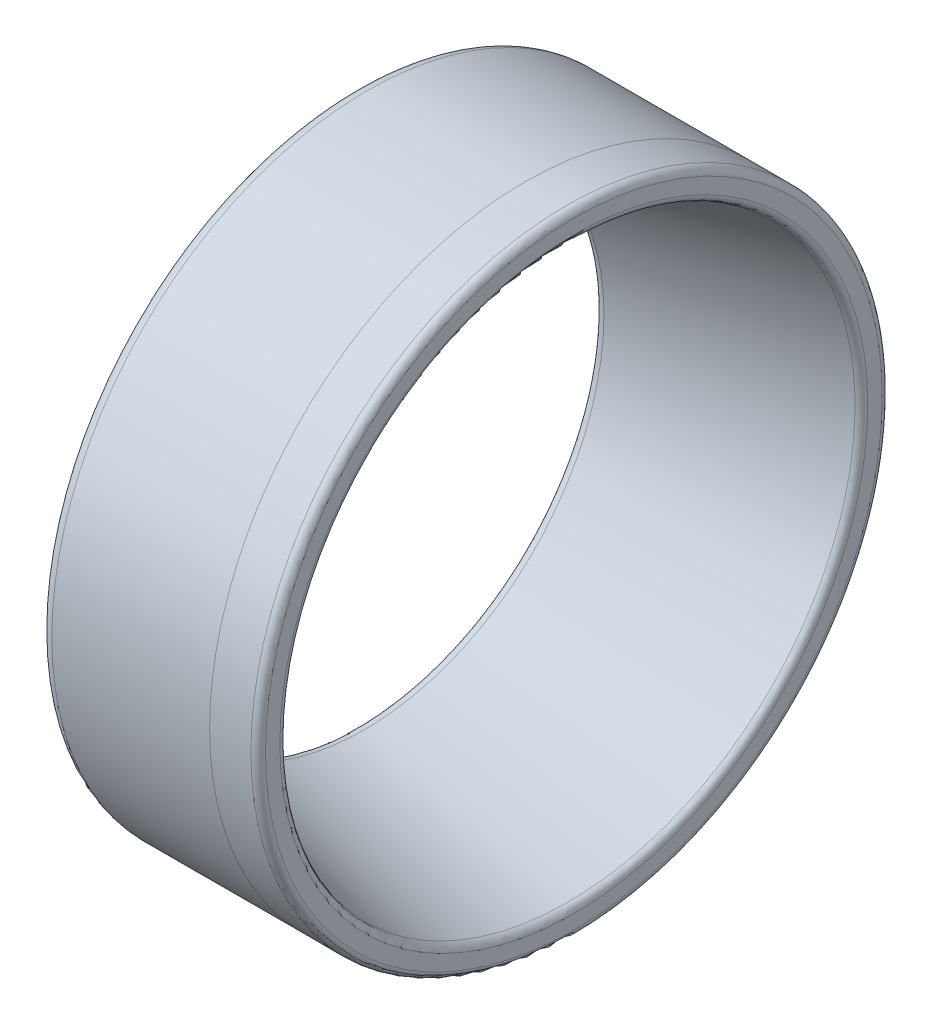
ISO-10303-21;
HEADER;
FILE_DESCRIPTION(('STEP AP214'),'2;1');
FILE_NAME('part.step','',(''),(''),'','','');
FILE_SCHEMA(('AUTOMOTIVE_DESIGN { 1 0 10303 214 1 1 1 1 }'));
ENDSEC;
DATA;
#1=APPLICATION_CONTEXT('core data for automotive mechanical design processes');
#2=APPLICATION_PROTOCOL_DEFINITION('international standard','automotive_design',2000,#1);
#3=PRODUCT_CONTEXT('',#1,'mechanical');
#4=PRODUCT('Part','Part','',(#3));
#5=PRODUCT_RELATED_PRODUCT_CATEGORY('part','',(#4));
#6=PRODUCT_DEFINITION_FORMATION('','',#4);
#7=PRODUCT_DEFINITION_CONTEXT('part definition',#1,'design');
#8=PRODUCT_DEFINITION('design','',#6,#7);
#9=PRODUCT_DEFINITION_SHAPE('','',#8);
#10=(LENGTH_UNIT() NAMED_UNIT(*) SI_UNIT(.MILLI.,.METRE.));
#11=(NAMED_UNIT(*) PLANE_ANGLE_UNIT() SI_UNIT($,.RADIAN.));
#12=(NAMED_UNIT(*) SI_UNIT($,.STERADIAN.) SOLID_ANGLE_UNIT());
#13=UNCERTAINTY_MEASURE_WITH_UNIT(LENGTH_MEASURE(1.E-05),#10,'distance_accuracy_value','');
#14=(GEOMETRIC_REPRESENTATION_CONTEXT(3) GLOBAL_UNCERTAINTY_ASSIGNED_CONTEXT((#13)) GLOBAL_UNIT_ASSIGNED_CONTEXT((#10,
#11,#12)) REPRESENTATION_CONTEXT('',''));
#15=CARTESIAN_POINT('',(0.,0.,0.));
#16=DIRECTION('',(0.,0.,1.));
#17=DIRECTION('',(1.,0.,0.));
#18=AXIS2_PLACEMENT_3D('',#15,#16,#17);
#19=CARTESIAN_POINT('',(-17.990056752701,0.,0.));
#20=DIRECTION('',(-1.,0.,0.));
#21=DIRECTION('',(0.,0.,1.));
#22=AXIS2_PLACEMENT_3D('',#19,#20,#21);
#23=CYLINDRICAL_SURFACE('',#22,26.);
#24=CARTESIAN_POINT('',(3.4,0.,0.));
#25=DIRECTION('',(-1.,0.,0.));
#26=DIRECTION('',(0.,0.,1.));
#27=AXIS2_PLACEMENT_3D('',#24,#25,#26);
#28=CIRCLE('',#27,26.);
#29=CARTESIAN_POINT('',(3.4,0.,26.));
#30=VERTEX_POINT('',#29);
#31=EDGE_CURVE('E74',#30,#30,#28,.T.);
#32=ORIENTED_EDGE('',*,*,#31,.T.);
#33=EDGE_LOOP('',(#32));
#34=FACE_BOUND('',#33,.T.);
#35=CARTESIAN_POINT('',(0.,0.,0.));
#36=DIRECTION('',(-1.,0.,0.));
#37=DIRECTION('',(0.,-1.,0.));
#38=AXIS2_PLACEMENT_3D('',#35,#36,#37);
#39=CIRCLE('',#38,26.);
#40=CARTESIAN_POINT('',(0.,-26.,0.));
#41=VERTEX_POINT('',#40);
#42=CARTESIAN_POINT('',(0.,26.,0.));
#43=VERTEX_POINT('',#42);
#44=EDGE_CURVE('E11',#41,#43,#39,.T.);
#45=ORIENTED_EDGE('',*,*,#44,.F.);
#46=EDGE_CURVE('E37',#43,#41,#39,.T.);
#47=ORIENTED_EDGE('',*,*,#46,.F.);
#48=EDGE_LOOP('',(#45,#47));
#49=FACE_BOUND('',#48,.T.);
#50=ADVANCED_FACE('F33',(#34,#49),#23,.T.);
#51=CARTESIAN_POINT('',(-13.,0.,0.));
#52=DIRECTION('',(-1.,0.,0.));
#53=DIRECTION('',(0.,0.,1.));
#54=AXIS2_PLACEMENT_3D('',#51,#52,#53);
#55=TOROIDAL_SURFACE('',#54,25.,1.);
#56=CARTESIAN_POINT('',(-14.,0.,0.));
#57=DIRECTION('',(-1.,0.,0.));
#58=DIRECTION('',(0.,0.,1.));
#59=AXIS2_PLACEMENT_3D('',#56,#57,#58);
#60=CIRCLE('',#59,25.);
#61=CARTESIAN_POINT('',(-14.,0.,25.));
#62=VERTEX_POINT('',#61);
#63=EDGE_CURVE('E52',#62,#62,#60,.T.);
#64=ORIENTED_EDGE('',*,*,#63,.F.);
#65=EDGE_LOOP('',(#64));
#66=FACE_BOUND('',#65,.T.);
#67=CARTESIAN_POINT('',(-13.,0.,0.));
#68=DIRECTION('',(-1.,0.,0.));
#69=DIRECTION('',(0.,0.,1.));
#70=AXIS2_PLACEMENT_3D('',#67,#68,#69);
#71=CIRCLE('',#70,26.);
#72=CARTESIAN_POINT('',(-13.,0.,26.));
#73=VERTEX_POINT('',#72);
#74=EDGE_CURVE('E77',#73,#73,#71,.T.);
#75=ORIENTED_EDGE('',*,*,#74,.T.);
#76=EDGE_LOOP('',(#75));
#77=FACE_BOUND('',#76,.T.);
#78=ADVANCED_FACE('F35',(#66,#77),#55,.T.);
#79=CARTESIAN_POINT('',(-14.,20.333869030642,0.));
#80=DIRECTION('',(1.,0.,0.));
#81=DIRECTION('',(0.,0.,-1.));
#82=AXIS2_PLACEMENT_3D('',#79,#80,#81);
#83=PLANE('',#82);
#84=CARTESIAN_POINT('',(-14.,0.,0.));
#85=DIRECTION('',(-1.,0.,0.));
#86=DIRECTION('',(0.,0.,1.));
#87=AXIS2_PLACEMENT_3D('',#84,#85,#86);
#88=CIRCLE('',#87,20.333869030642);
#89=CARTESIAN_POINT('',(-14.,0.,20.333869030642));
#90=VERTEX_POINT('',#89);
#91=EDGE_CURVE('E56',#90,#90,#88,.T.);
#92=ORIENTED_EDGE('',*,*,#91,.F.);
#93=EDGE_LOOP('',(#92));
#94=FACE_BOUND('',#93,.T.);
#95=ORIENTED_EDGE('',*,*,#63,.T.);
#96=EDGE_LOOP('',(#95));
#97=FACE_BOUND('',#96,.T.);
#98=ADVANCED_FACE('F95',(#94,#97),#83,.F.);
#99=CARTESIAN_POINT('',(-13.4,0.,0.));
#100=DIRECTION('',(-1.,0.,0.));
#101=DIRECTION('',(0.,0.,1.));
#102=AXIS2_PLACEMENT_3D('',#99,#100,#101);
#103=TOROIDAL_SURFACE('',#102,20.333869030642,0.600000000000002);
#104=CARTESIAN_POINT('',(-13.2650293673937,0.,0.));
#105=DIRECTION('',(-1.,0.,0.));
#106=DIRECTION('',(0.,0.,1.));
#107=AXIS2_PLACEMENT_3D('',#104,#105,#106);
#108=CIRCLE('',#107,19.7492469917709);
#109=CARTESIAN_POINT('',(-13.2650293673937,0.,19.7492469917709));
#110=VERTEX_POINT('',#109);
#111=EDGE_CURVE('E60',#110,#110,#108,.T.);
#112=ORIENTED_EDGE('',*,*,#111,.F.);
#113=EDGE_LOOP('',(#112));
#114=FACE_BOUND('',#113,.T.);
#115=ORIENTED_EDGE('',*,*,#91,.T.);
#116=EDGE_LOOP('',(#115));
#117=FACE_BOUND('',#116,.T.);
#118=ADVANCED_FACE('F115',(#114,#117),#103,.T.);
#119=CARTESIAN_POINT('',(-13.2650293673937,0.,0.));
#120=DIRECTION('',(1.,0.,0.));
#121=DIRECTION('',(0.,0.,-1.));
#122=AXIS2_PLACEMENT_3D('',#119,#120,#121);
#123=CONICAL_SURFACE('',#122,19.7492469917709,0.226892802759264);
#124=CARTESIAN_POINT('',(3.53497063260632,0.,0.));
#125=DIRECTION('',(-1.,0.,0.));
#126=DIRECTION('',(0.,0.,1.));
#127=AXIS2_PLACEMENT_3D('',#124,#125,#126);
#128=CIRCLE('',#127,23.6278326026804);
#129=CARTESIAN_POINT('',(3.53497063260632,0.,23.6278326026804));
#130=VERTEX_POINT('',#129);
#131=EDGE_CURVE('E65',#130,#130,#128,.T.);
#132=ORIENTED_EDGE('',*,*,#131,.F.);
#133=EDGE_LOOP('',(#132));
#134=FACE_BOUND('',#133,.T.);
#135=ORIENTED_EDGE('',*,*,#111,.T.);
#136=EDGE_LOOP('',(#135));
#137=FACE_BOUND('',#136,.T.);
#138=ADVANCED_FACE('F109',(#134,#137),#123,.F.);
#139=CARTESIAN_POINT('',(3.4,0.,0.));
#140=DIRECTION('',(-1.,0.,0.));
#141=DIRECTION('',(0.,0.,1.));
#142=AXIS2_PLACEMENT_3D('',#139,#140,#141);
#143=TOROIDAL_SURFACE('',#142,24.2124546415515,0.600000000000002);
#144=CARTESIAN_POINT('',(4.,0.,0.));
#145=DIRECTION('',(-1.,0.,0.));
#146=DIRECTION('',(0.,0.,1.));
#147=AXIS2_PLACEMENT_3D('',#144,#145,#146);
#148=CIRCLE('',#147,24.2124546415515);
#149=CARTESIAN_POINT('',(4.,0.,24.2124546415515));
#150=VERTEX_POINT('',#149);
#151=EDGE_CURVE('E68',#150,#150,#148,.T.);
#152=ORIENTED_EDGE('',*,*,#151,.F.);
#153=EDGE_LOOP('',(#152));
#154=FACE_BOUND('',#153,.T.);
#155=ORIENTED_EDGE('',*,*,#131,.T.);
#156=EDGE_LOOP('',(#155));
#157=FACE_BOUND('',#156,.T.);
#158=ADVANCED_FACE('F103',(#154,#157),#143,.T.);
#159=CARTESIAN_POINT('',(4.,25.4,0.));
#160=DIRECTION('',(-1.,0.,0.));
#161=DIRECTION('',(0.,0.,1.));
#162=AXIS2_PLACEMENT_3D('',#159,#160,#161);
#163=PLANE('',#162);
#164=CARTESIAN_POINT('',(4.,0.,0.));
#165=DIRECTION('',(-1.,0.,0.));
#166=DIRECTION('',(0.,0.,1.));
#167=AXIS2_PLACEMENT_3D('',#164,#165,#166);
#168=CIRCLE('',#167,25.4);
#169=CARTESIAN_POINT('',(4.,0.,25.4));
#170=VERTEX_POINT('',#169);
#171=EDGE_CURVE('E71',#170,#170,#168,.T.);
#172=ORIENTED_EDGE('',*,*,#171,.F.);
#173=EDGE_LOOP('',(#172));
#174=FACE_BOUND('',#173,.T.);
#175=ORIENTED_EDGE('',*,*,#151,.T.);
#176=EDGE_LOOP('',(#175));
#177=FACE_BOUND('',#176,.T.);
#178=ADVANCED_FACE('F87',(#174,#177),#163,.F.);
#179=CARTESIAN_POINT('',(3.4,0.,0.));
#180=DIRECTION('',(-1.,0.,0.));
#181=DIRECTION('',(0.,0.,1.));
#182=AXIS2_PLACEMENT_3D('',#179,#180,#181);
#183=TOROIDAL_SURFACE('',#182,25.4,0.6);
#184=ORIENTED_EDGE('',*,*,#31,.F.);
#185=EDGE_LOOP('',(#184));
#186=FACE_BOUND('',#185,.T.);
#187=ORIENTED_EDGE('',*,*,#171,.T.);
#188=EDGE_LOOP('',(#187));
#189=FACE_BOUND('',#188,.T.);
#190=ADVANCED_FACE('F82',(#186,#189),#183,.T.);
#191=ORIENTED_EDGE('',*,*,#46,.T.);
#192=ORIENTED_EDGE('',*,*,#44,.T.);
#193=EDGE_LOOP('',(#191,#192));
#194=FACE_BOUND('',#193,.T.);
#195=ORIENTED_EDGE('',*,*,#74,.F.);
#196=EDGE_LOOP('',(#195));
#197=FACE_BOUND('',#196,.T.);
#198=ADVANCED_FACE('F49',(#194,#197),#23,.T.);
#199=CLOSED_SHELL('',(#50,#78,#98,#118,#138,#158,#178,#190,#198));
#200=MANIFOLD_SOLID_BREP('B2',#199);
#201=ADVANCED_BREP_SHAPE_REPRESENTATION('',(#18,#200),#14);
#202=SHAPE_DEFINITION_REPRESENTATION(#9,#201);
ENDSEC;
END-ISO-10303-21;
